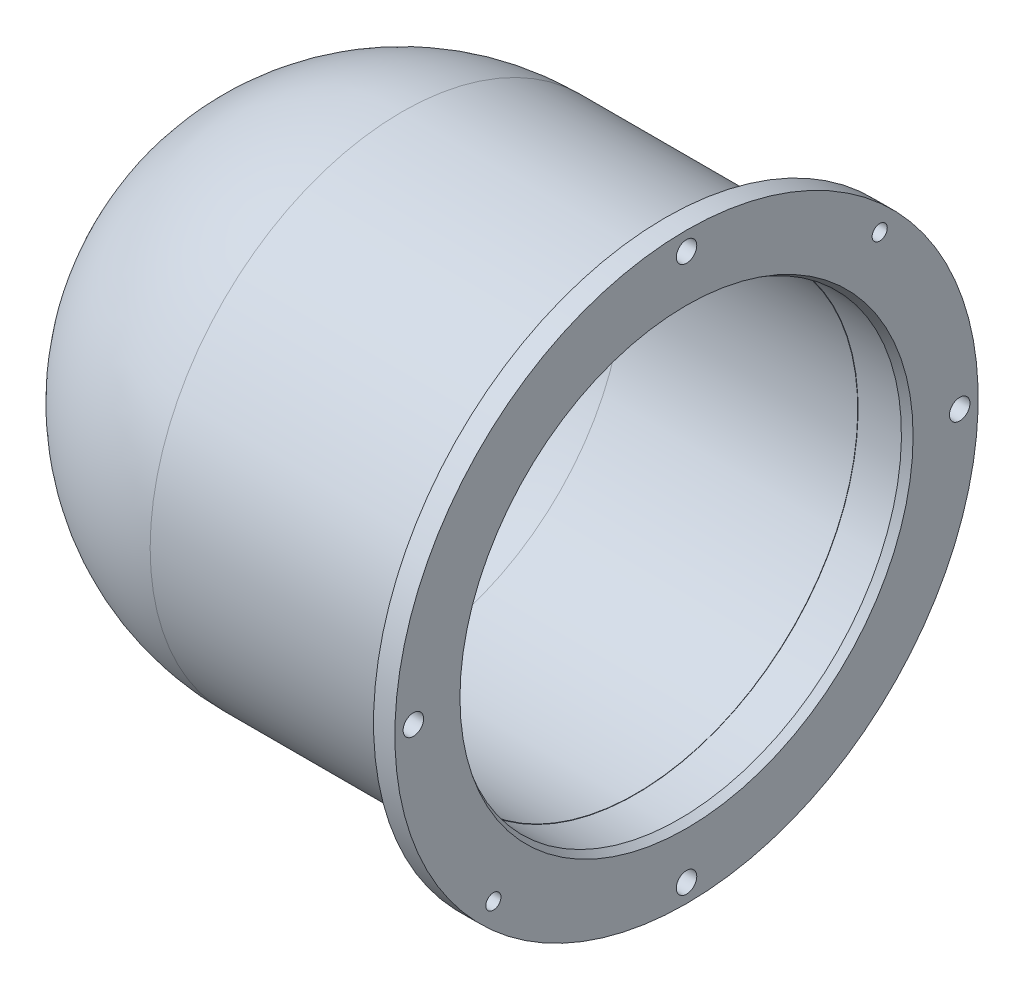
ISO-10303-21;
HEADER;
FILE_DESCRIPTION(('STEP AP214'),'2;1');
FILE_NAME('part.step','',(''),(''),'','','');
FILE_SCHEMA(('AUTOMOTIVE_DESIGN { 1 0 10303 214 1 1 1 1 }'));
ENDSEC;
DATA;
#1=APPLICATION_CONTEXT('core data for automotive mechanical design processes');
#2=APPLICATION_PROTOCOL_DEFINITION('international standard','automotive_design',2000,#1);
#3=PRODUCT_CONTEXT('',#1,'mechanical');
#4=PRODUCT('Part','Part','',(#3));
#5=PRODUCT_RELATED_PRODUCT_CATEGORY('part','',(#4));
#6=PRODUCT_DEFINITION_FORMATION('','',#4);
#7=PRODUCT_DEFINITION_CONTEXT('part definition',#1,'design');
#8=PRODUCT_DEFINITION('design','',#6,#7);
#9=PRODUCT_DEFINITION_SHAPE('','',#8);
#10=(LENGTH_UNIT() NAMED_UNIT(*) SI_UNIT(.MILLI.,.METRE.));
#11=(NAMED_UNIT(*) PLANE_ANGLE_UNIT() SI_UNIT($,.RADIAN.));
#12=(NAMED_UNIT(*) SI_UNIT($,.STERADIAN.) SOLID_ANGLE_UNIT());
#13=UNCERTAINTY_MEASURE_WITH_UNIT(LENGTH_MEASURE(1.E-05),#10,'distance_accuracy_value','');
#14=(GEOMETRIC_REPRESENTATION_CONTEXT(3) GLOBAL_UNCERTAINTY_ASSIGNED_CONTEXT((#13)) GLOBAL_UNIT_ASSIGNED_CONTEXT((#10,
#11,#12)) REPRESENTATION_CONTEXT('',''));
#15=CARTESIAN_POINT('',(0.,0.,0.));
#16=DIRECTION('',(0.,0.,1.));
#17=DIRECTION('',(1.,0.,0.));
#18=AXIS2_PLACEMENT_3D('',#15,#16,#17);
#19=CARTESIAN_POINT('',(-90.8114323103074,0.,0.));
#20=DIRECTION('',(1.,0.,0.));
#21=DIRECTION('',(0.,1.,0.));
#22=AXIS2_PLACEMENT_3D('',#19,#20,#21);
#23=CYLINDRICAL_SURFACE('',#22,44.958);
#24=CARTESIAN_POINT('',(-4.57199999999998,0.,0.));
#25=DIRECTION('',(1.,0.,0.));
#26=DIRECTION('',(0.,1.,0.));
#27=AXIS2_PLACEMENT_3D('',#24,#25,#26);
#28=CIRCLE('',#27,44.958);
#29=CARTESIAN_POINT('',(-4.57199999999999,44.958,0.));
#30=VERTEX_POINT('',#29);
#31=EDGE_CURVE('E10',#30,#30,#28,.F.);
#32=ORIENTED_EDGE('',*,*,#31,.T.);
#33=EDGE_LOOP('',(#32));
#34=FACE_BOUND('',#33,.T.);
#35=CARTESIAN_POINT('',(-50.8,0.,0.));
#36=DIRECTION('',(1.,0.,0.));
#37=DIRECTION('',(0.,1.,0.));
#38=AXIS2_PLACEMENT_3D('',#35,#36,#37);
#39=CIRCLE('',#38,44.958);
#40=CARTESIAN_POINT('',(-50.8,44.958,0.));
#41=VERTEX_POINT('',#40);
#42=EDGE_CURVE('E103',#41,#41,#39,.T.);
#43=ORIENTED_EDGE('',*,*,#42,.T.);
#44=EDGE_LOOP('',(#43));
#45=FACE_BOUND('',#44,.T.);
#46=ADVANCED_FACE('F34',(#34,#45),#23,.T.);
#47=CARTESIAN_POINT('',(-50.8,0.,0.));
#48=DIRECTION('',(1.,0.,0.));
#49=DIRECTION('',(0.,1.,0.));
#50=AXIS2_PLACEMENT_3D('',#47,#48,#49);
#51=SPHERICAL_SURFACE('',#50,44.958);
#52=CARTESIAN_POINT('',(-93.98,0.,0.));
#53=DIRECTION('',(1.,0.,0.));
#54=DIRECTION('',(0.,1.,0.));
#55=AXIS2_PLACEMENT_3D('',#52,#53,#54);
#56=CIRCLE('',#55,12.5183610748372);
#57=CARTESIAN_POINT('',(-93.98,12.5183610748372,0.));
#58=VERTEX_POINT('',#57);
#59=EDGE_CURVE('E84',#58,#58,#56,.F.);
#60=ORIENTED_EDGE('',*,*,#59,.F.);
#61=EDGE_LOOP('',(#60));
#62=FACE_BOUND('',#61,.T.);
#63=ORIENTED_EDGE('',*,*,#42,.F.);
#64=EDGE_LOOP('',(#63));
#65=FACE_BOUND('',#64,.T.);
#66=ADVANCED_FACE('F151',(#62,#65),#51,.T.);
#67=CARTESIAN_POINT('',(-88.3336032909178,-58.888094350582,0.));
#68=DIRECTION('',(1.,0.,0.));
#69=DIRECTION('',(0.,1.,0.));
#70=AXIS2_PLACEMENT_3D('',#67,#68,#69);
#71=PLANE('',#70);
#72=CARTESIAN_POINT('',(-88.3336032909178,0.,0.));
#73=DIRECTION('',(1.,0.,0.));
#74=DIRECTION('',(0.,1.,0.));
#75=AXIS2_PLACEMENT_3D('',#72,#73,#74);
#76=CIRCLE('',#75,5.75436999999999);
#77=CARTESIAN_POINT('',(-88.3336032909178,5.75436999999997,0.));
#78=VERTEX_POINT('',#77);
#79=EDGE_CURVE('E81',#78,#78,#76,.T.);
#80=ORIENTED_EDGE('',*,*,#79,.F.);
#81=EDGE_LOOP('',(#80));
#82=FACE_BOUND('',#81,.T.);
#83=CARTESIAN_POINT('',(-88.3336032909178,0.,0.));
#84=DIRECTION('',(1.,0.,0.));
#85=DIRECTION('',(0.,1.,0.));
#86=AXIS2_PLACEMENT_3D('',#83,#84,#85);
#87=CIRCLE('',#86,12.7);
#88=CARTESIAN_POINT('',(-88.3336032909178,12.7,0.));
#89=VERTEX_POINT('',#88);
#90=EDGE_CURVE('E100',#89,#89,#87,.T.);
#91=ORIENTED_EDGE('',*,*,#90,.T.);
#92=EDGE_LOOP('',(#91));
#93=FACE_BOUND('',#92,.T.);
#94=ADVANCED_FACE('F155',(#82,#93),#71,.T.);
#95=CARTESIAN_POINT('',(-50.8,0.,0.));
#96=DIRECTION('',(1.,0.,0.));
#97=DIRECTION('',(0.,1.,0.));
#98=AXIS2_PLACEMENT_3D('',#95,#96,#97);
#99=SPHERICAL_SURFACE('',#98,39.624);
#100=ORIENTED_EDGE('',*,*,#90,.F.);
#101=EDGE_LOOP('',(#100));
#102=FACE_BOUND('',#101,.T.);
#103=CARTESIAN_POINT('',(-50.8,0.,0.));
#104=DIRECTION('',(1.,0.,0.));
#105=DIRECTION('',(0.,1.,0.));
#106=AXIS2_PLACEMENT_3D('',#103,#104,#105);
#107=CIRCLE('',#106,39.624);
#108=CARTESIAN_POINT('',(-50.8,39.624,0.));
#109=VERTEX_POINT('',#108);
#110=EDGE_CURVE('E97',#109,#109,#107,.T.);
#111=ORIENTED_EDGE('',*,*,#110,.T.);
#112=EDGE_LOOP('',(#111));
#113=FACE_BOUND('',#112,.T.);
#114=ADVANCED_FACE('F146',(#102,#113),#99,.F.);
#115=CARTESIAN_POINT('',(-90.8114323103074,0.,0.));
#116=DIRECTION('',(1.,0.,0.));
#117=DIRECTION('',(0.,1.,0.));
#118=AXIS2_PLACEMENT_3D('',#115,#116,#117);
#119=CYLINDRICAL_SURFACE('',#118,39.624);
#120=ORIENTED_EDGE('',*,*,#110,.F.);
#121=EDGE_LOOP('',(#120));
#122=FACE_BOUND('',#121,.T.);
#123=CARTESIAN_POINT('',(-9.05320611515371,0.,0.));
#124=DIRECTION('',(1.,0.,0.));
#125=DIRECTION('',(0.,1.,0.));
#126=AXIS2_PLACEMENT_3D('',#123,#124,#125);
#127=CIRCLE('',#126,39.624);
#128=CARTESIAN_POINT('',(-9.05320611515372,39.624,0.));
#129=VERTEX_POINT('',#128);
#130=EDGE_CURVE('E94',#129,#129,#127,.T.);
#131=ORIENTED_EDGE('',*,*,#130,.T.);
#132=EDGE_LOOP('',(#131));
#133=FACE_BOUND('',#132,.T.);
#134=ADVANCED_FACE('F140',(#122,#133),#119,.F.);
#135=CARTESIAN_POINT('',(-9.0532061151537,-58.888094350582,0.));
#136=DIRECTION('',(-1.,0.,0.));
#137=DIRECTION('',(0.,-1.,0.));
#138=AXIS2_PLACEMENT_3D('',#135,#136,#137);
#139=PLANE('',#138);
#140=ORIENTED_EDGE('',*,*,#130,.F.);
#141=EDGE_LOOP('',(#140));
#142=FACE_BOUND('',#141,.T.);
#143=CARTESIAN_POINT('',(-9.05320611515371,0.,0.));
#144=DIRECTION('',(1.,0.,0.));
#145=DIRECTION('',(0.,1.,0.));
#146=AXIS2_PLACEMENT_3D('',#143,#144,#145);
#147=CIRCLE('',#146,39.6875);
#148=CARTESIAN_POINT('',(-9.05320611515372,39.6875,0.));
#149=VERTEX_POINT('',#148);
#150=EDGE_CURVE('E91',#149,#149,#147,.T.);
#151=ORIENTED_EDGE('',*,*,#150,.T.);
#152=EDGE_LOOP('',(#151));
#153=FACE_BOUND('',#152,.T.);
#154=ADVANCED_FACE('F135',(#142,#153),#139,.F.);
#155=CARTESIAN_POINT('',(-90.8114323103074,0.,0.));
#156=DIRECTION('',(1.,0.,0.));
#157=DIRECTION('',(0.,1.,0.));
#158=AXIS2_PLACEMENT_3D('',#155,#156,#157);
#159=CYLINDRICAL_SURFACE('',#158,39.6875);
#160=CARTESIAN_POINT('',(-1.31982271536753,0.,0.));
#161=DIRECTION('',(1.,0.,0.));
#162=DIRECTION('',(0.,1.,0.));
#163=AXIS2_PLACEMENT_3D('',#160,#161,#162);
#164=CIRCLE('',#163,39.6875);
#165=CARTESIAN_POINT('',(-1.31982271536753,39.6875,0.));
#166=VERTEX_POINT('',#165);
#167=EDGE_CURVE('E106',#166,#166,#164,.T.);
#168=ORIENTED_EDGE('',*,*,#167,.T.);
#169=EDGE_LOOP('',(#168));
#170=FACE_BOUND('',#169,.T.);
#171=ORIENTED_EDGE('',*,*,#150,.F.);
#172=EDGE_LOOP('',(#171));
#173=FACE_BOUND('',#172,.T.);
#174=ADVANCED_FACE('F132',(#170,#173),#159,.F.);
#175=CARTESIAN_POINT('',(0.,-58.888094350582,0.));
#176=DIRECTION('',(1.,0.,0.));
#177=DIRECTION('',(0.,1.,0.));
#178=AXIS2_PLACEMENT_3D('',#175,#176,#177);
#179=PLANE('',#178);
#180=CARTESIAN_POINT('',(0.,-34.484183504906,34.4841835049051));
#181=DIRECTION('',(1.,0.,0.));
#182=DIRECTION('',(0.,0.,-1.));
#183=AXIS2_PLACEMENT_3D('',#180,#181,#182);
#184=CIRCLE('',#183,1.35254999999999);
#185=CARTESIAN_POINT('',(0.,-34.484183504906,33.1316335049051));
#186=VERTEX_POINT('',#185);
#187=EDGE_CURVE('E63',#186,#186,#184,.T.);
#188=ORIENTED_EDGE('',*,*,#187,.F.);
#189=EDGE_LOOP('',(#188));
#190=FACE_BOUND('',#189,.T.);
#191=CARTESIAN_POINT('',(0.,34.4841835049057,-34.4841835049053));
#192=DIRECTION('',(1.,0.,0.));
#193=DIRECTION('',(0.,0.,-1.));
#194=AXIS2_PLACEMENT_3D('',#191,#192,#193);
#195=CIRCLE('',#194,1.35254999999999);
#196=CARTESIAN_POINT('',(0.,34.4841835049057,-35.8367335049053));
#197=VERTEX_POINT('',#196);
#198=EDGE_CURVE('E52',#197,#197,#195,.T.);
#199=ORIENTED_EDGE('',*,*,#198,.F.);
#200=EDGE_LOOP('',(#199));
#201=FACE_BOUND('',#200,.T.);
#202=CARTESIAN_POINT('',(0.,0.,0.));
#203=DIRECTION('',(1.,0.,0.));
#204=DIRECTION('',(0.,1.,0.));
#205=AXIS2_PLACEMENT_3D('',#202,#203,#204);
#206=CIRCLE('',#205,40.4495);
#207=CARTESIAN_POINT('',(0.,40.4495,0.));
#208=VERTEX_POINT('',#207);
#209=EDGE_CURVE('E46',#208,#208,#206,.F.);
#210=ORIENTED_EDGE('',*,*,#209,.T.);
#211=EDGE_LOOP('',(#210));
#212=FACE_BOUND('',#211,.T.);
#213=CARTESIAN_POINT('',(0.,5.10817981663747E-13,-48.768));
#214=DIRECTION('',(1.,0.,0.));
#215=DIRECTION('',(0.,0.,-1.));
#216=AXIS2_PLACEMENT_3D('',#213,#214,#215);
#217=CIRCLE('',#216,1.8288);
#218=CARTESIAN_POINT('',(0.,5.29973655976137E-13,-50.5968));
#219=VERTEX_POINT('',#218);
#220=EDGE_CURVE('E51',#219,#219,#217,.T.);
#221=ORIENTED_EDGE('',*,*,#220,.F.);
#222=EDGE_LOOP('',(#221));
#223=FACE_BOUND('',#222,.T.);
#224=CARTESIAN_POINT('',(0.,-48.768,-3.40545321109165E-13));
#225=DIRECTION('',(1.,0.,0.));
#226=DIRECTION('',(0.,-1.,0.));
#227=AXIS2_PLACEMENT_3D('',#224,#225,#226);
#228=CIRCLE('',#227,1.8288);
#229=CARTESIAN_POINT('',(0.,-50.5968,-3.53315770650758E-13));
#230=VERTEX_POINT('',#229);
#231=EDGE_CURVE('E66',#230,#230,#228,.T.);
#232=ORIENTED_EDGE('',*,*,#231,.F.);
#233=EDGE_LOOP('',(#232));
#234=FACE_BOUND('',#233,.T.);
#235=CARTESIAN_POINT('',(0.,-1.70272660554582E-13,48.768));
#236=DIRECTION('',(1.,0.,0.));
#237=DIRECTION('',(0.,0.,1.));
#238=AXIS2_PLACEMENT_3D('',#235,#236,#237);
#239=CIRCLE('',#238,1.8288);
#240=CARTESIAN_POINT('',(0.,-1.76657885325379E-13,50.5968));
#241=VERTEX_POINT('',#240);
#242=EDGE_CURVE('E70',#241,#241,#239,.T.);
#243=ORIENTED_EDGE('',*,*,#242,.F.);
#244=EDGE_LOOP('',(#243));
#245=FACE_BOUND('',#244,.T.);
#246=CARTESIAN_POINT('',(0.,48.768,0.));
#247=DIRECTION('',(1.,0.,0.));
#248=DIRECTION('',(0.,1.,0.));
#249=AXIS2_PLACEMENT_3D('',#246,#247,#248);
#250=CIRCLE('',#249,1.8288);
#251=CARTESIAN_POINT('',(0.,50.5968,0.));
#252=VERTEX_POINT('',#251);
#253=EDGE_CURVE('E74',#252,#252,#250,.T.);
#254=ORIENTED_EDGE('',*,*,#253,.F.);
#255=EDGE_LOOP('',(#254));
#256=FACE_BOUND('',#255,.T.);
#257=CARTESIAN_POINT('',(0.,0.,0.));
#258=DIRECTION('',(1.,0.,0.));
#259=DIRECTION('',(0.,1.,0.));
#260=AXIS2_PLACEMENT_3D('',#257,#258,#259);
#261=CIRCLE('',#260,52.07);
#262=CARTESIAN_POINT('',(0.,52.07,0.));
#263=VERTEX_POINT('',#262);
#264=EDGE_CURVE('E88',#263,#263,#261,.T.);
#265=ORIENTED_EDGE('',*,*,#264,.T.);
#266=EDGE_LOOP('',(#265));
#267=FACE_BOUND('',#266,.T.);
#268=ADVANCED_FACE('F121',(#190,#201,#212,#223,#234,#245,#256,#267),#179,.T.);
#269=CARTESIAN_POINT('',(-90.8114323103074,0.,0.));
#270=DIRECTION('',(1.,0.,0.));
#271=DIRECTION('',(0.,1.,0.));
#272=AXIS2_PLACEMENT_3D('',#269,#270,#271);
#273=CYLINDRICAL_SURFACE('',#272,52.07);
#274=ORIENTED_EDGE('',*,*,#264,.F.);
#275=EDGE_LOOP('',(#274));
#276=FACE_BOUND('',#275,.T.);
#277=CARTESIAN_POINT('',(-3.80999999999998,0.,0.));
#278=DIRECTION('',(1.,0.,0.));
#279=DIRECTION('',(0.,1.,0.));
#280=AXIS2_PLACEMENT_3D('',#277,#278,#279);
#281=CIRCLE('',#280,52.07);
#282=CARTESIAN_POINT('',(-3.80999999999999,52.07,0.));
#283=VERTEX_POINT('',#282);
#284=EDGE_CURVE('E85',#283,#283,#281,.T.);
#285=ORIENTED_EDGE('',*,*,#284,.T.);
#286=EDGE_LOOP('',(#285));
#287=FACE_BOUND('',#286,.T.);
#288=ADVANCED_FACE('F192',(#276,#287),#273,.T.);
#289=CARTESIAN_POINT('',(-3.80999999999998,-58.888094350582,0.));
#290=DIRECTION('',(1.,0.,0.));
#291=DIRECTION('',(0.,1.,0.));
#292=AXIS2_PLACEMENT_3D('',#289,#290,#291);
#293=PLANE('',#292);
#294=CARTESIAN_POINT('',(-3.80999999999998,-34.484183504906,34.4841835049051));
#295=DIRECTION('',(1.,0.,0.));
#296=DIRECTION('',(0.,1.,0.));
#297=AXIS2_PLACEMENT_3D('',#294,#295,#296);
#298=CIRCLE('',#297,1.35254999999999);
#299=CARTESIAN_POINT('',(-3.80999999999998,-33.131633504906,34.4841835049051));
#300=VERTEX_POINT('',#299);
#301=EDGE_CURVE('E37',#300,#300,#298,.T.);
#302=ORIENTED_EDGE('',*,*,#301,.T.);
#303=EDGE_LOOP('',(#302));
#304=FACE_BOUND('',#303,.T.);
#305=CARTESIAN_POINT('',(-3.80999999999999,34.4841835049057,-34.4841835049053));
#306=DIRECTION('',(1.,0.,0.));
#307=DIRECTION('',(0.,1.,0.));
#308=AXIS2_PLACEMENT_3D('',#305,#306,#307);
#309=CIRCLE('',#308,1.35254999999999);
#310=CARTESIAN_POINT('',(-3.80999999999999,35.8367335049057,-34.4841835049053));
#311=VERTEX_POINT('',#310);
#312=EDGE_CURVE('E49',#311,#311,#309,.T.);
#313=ORIENTED_EDGE('',*,*,#312,.T.);
#314=EDGE_LOOP('',(#313));
#315=FACE_BOUND('',#314,.T.);
#316=CARTESIAN_POINT('',(-3.80999999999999,0.,0.));
#317=DIRECTION('',(1.,0.,0.));
#318=DIRECTION('',(0.,1.,0.));
#319=AXIS2_PLACEMENT_3D('',#316,#317,#318);
#320=CIRCLE('',#319,45.72);
#321=CARTESIAN_POINT('',(-3.81,45.72,0.));
#322=VERTEX_POINT('',#321);
#323=EDGE_CURVE('E41',#322,#322,#320,.T.);
#324=ORIENTED_EDGE('',*,*,#323,.T.);
#325=EDGE_LOOP('',(#324));
#326=FACE_BOUND('',#325,.T.);
#327=CARTESIAN_POINT('',(-3.80999999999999,5.10030828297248E-13,-48.768));
#328=DIRECTION('',(1.,0.,0.));
#329=DIRECTION('',(0.,1.,0.));
#330=AXIS2_PLACEMENT_3D('',#327,#328,#329);
#331=CIRCLE('',#330,1.8288);
#332=CARTESIAN_POINT('',(-3.80999999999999,1.82880000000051,-48.768));
#333=VERTEX_POINT('',#332);
#334=EDGE_CURVE('E56',#333,#333,#331,.T.);
#335=ORIENTED_EDGE('',*,*,#334,.T.);
#336=EDGE_LOOP('',(#335));
#337=FACE_BOUND('',#336,.T.);
#338=CARTESIAN_POINT('',(-3.80999999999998,-48.768,-3.40545321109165E-13));
#339=DIRECTION('',(1.,0.,0.));
#340=DIRECTION('',(0.,1.,0.));
#341=AXIS2_PLACEMENT_3D('',#338,#339,#340);
#342=CIRCLE('',#341,1.8288);
#343=CARTESIAN_POINT('',(-3.80999999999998,-46.9392,-3.40545321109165E-13));
#344=VERTEX_POINT('',#343);
#345=EDGE_CURVE('E69',#344,#344,#342,.T.);
#346=ORIENTED_EDGE('',*,*,#345,.T.);
#347=EDGE_LOOP('',(#346));
#348=FACE_BOUND('',#347,.T.);
#349=CARTESIAN_POINT('',(-3.80999999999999,-1.71059813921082E-13,48.768));
#350=DIRECTION('',(1.,0.,0.));
#351=DIRECTION('',(0.,1.,0.));
#352=AXIS2_PLACEMENT_3D('',#349,#350,#351);
#353=CIRCLE('',#352,1.8288);
#354=CARTESIAN_POINT('',(-3.80999999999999,1.82879999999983,48.768));
#355=VERTEX_POINT('',#354);
#356=EDGE_CURVE('E73',#355,#355,#353,.T.);
#357=ORIENTED_EDGE('',*,*,#356,.T.);
#358=EDGE_LOOP('',(#357));
#359=FACE_BOUND('',#358,.T.);
#360=CARTESIAN_POINT('',(-3.80999999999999,48.768,0.));
#361=DIRECTION('',(1.,0.,0.));
#362=DIRECTION('',(0.,1.,0.));
#363=AXIS2_PLACEMENT_3D('',#360,#361,#362);
#364=CIRCLE('',#363,1.8288);
#365=CARTESIAN_POINT('',(-3.80999999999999,50.5968,0.));
#366=VERTEX_POINT('',#365);
#367=EDGE_CURVE('E77',#366,#366,#364,.T.);
#368=ORIENTED_EDGE('',*,*,#367,.T.);
#369=EDGE_LOOP('',(#368));
#370=FACE_BOUND('',#369,.T.);
#371=ORIENTED_EDGE('',*,*,#284,.F.);
#372=EDGE_LOOP('',(#371));
#373=FACE_BOUND('',#372,.T.);
#374=ADVANCED_FACE('F196',(#304,#315,#326,#337,#348,#359,#370,#373),#293,.F.);
#375=CARTESIAN_POINT('',(-93.98,0.,0.));
#376=DIRECTION('',(1.,0.,0.));
#377=DIRECTION('',(0.,1.,0.));
#378=AXIS2_PLACEMENT_3D('',#375,#376,#377);
#379=PLANE('',#378);
#380=CARTESIAN_POINT('',(-93.98,0.,0.));
#381=DIRECTION('',(-1.,0.,0.));
#382=DIRECTION('',(0.,0.,1.));
#383=AXIS2_PLACEMENT_3D('',#380,#381,#382);
#384=CIRCLE('',#383,5.75436999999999);
#385=CARTESIAN_POINT('',(-93.98,0.,5.75436999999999));
#386=VERTEX_POINT('',#385);
#387=EDGE_CURVE('E78',#386,#386,#384,.T.);
#388=ORIENTED_EDGE('',*,*,#387,.F.);
#389=EDGE_LOOP('',(#388));
#390=FACE_BOUND('',#389,.T.);
#391=ORIENTED_EDGE('',*,*,#59,.T.);
#392=EDGE_LOOP('',(#391));
#393=FACE_BOUND('',#392,.T.);
#394=ADVANCED_FACE('F216',(#390,#393),#379,.F.);
#395=CARTESIAN_POINT('',(-93.98,0.,0.));
#396=DIRECTION('',(-1.,0.,0.));
#397=DIRECTION('',(0.,0.,1.));
#398=AXIS2_PLACEMENT_3D('',#395,#396,#397);
#399=CYLINDRICAL_SURFACE('',#398,5.75436999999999);
#400=ORIENTED_EDGE('',*,*,#79,.T.);
#401=EDGE_LOOP('',(#400));
#402=FACE_BOUND('',#401,.T.);
#403=ORIENTED_EDGE('',*,*,#387,.T.);
#404=EDGE_LOOP('',(#403));
#405=FACE_BOUND('',#404,.T.);
#406=ADVANCED_FACE('F221',(#402,#405),#399,.F.);
#407=CARTESIAN_POINT('',(-93.98,48.768,0.));
#408=DIRECTION('',(1.,0.,0.));
#409=DIRECTION('',(0.,1.,0.));
#410=AXIS2_PLACEMENT_3D('',#407,#408,#409);
#411=CYLINDRICAL_SURFACE('',#410,1.8288);
#412=ORIENTED_EDGE('',*,*,#253,.T.);
#413=EDGE_LOOP('',(#412));
#414=FACE_BOUND('',#413,.T.);
#415=ORIENTED_EDGE('',*,*,#367,.F.);
#416=EDGE_LOOP('',(#415));
#417=FACE_BOUND('',#416,.T.);
#418=ADVANCED_FACE('F232',(#414,#417),#411,.F.);
#419=CARTESIAN_POINT('',(-93.98,-1.89689110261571E-13,48.768));
#420=DIRECTION('',(1.,0.,0.));
#421=DIRECTION('',(0.,1.,0.));
#422=AXIS2_PLACEMENT_3D('',#419,#420,#421);
#423=CYLINDRICAL_SURFACE('',#422,1.8288);
#424=ORIENTED_EDGE('',*,*,#242,.T.);
#425=EDGE_LOOP('',(#424));
#426=FACE_BOUND('',#425,.T.);
#427=ORIENTED_EDGE('',*,*,#356,.F.);
#428=EDGE_LOOP('',(#427));
#429=FACE_BOUND('',#428,.T.);
#430=ADVANCED_FACE('F244',(#426,#429),#423,.F.);
#431=CARTESIAN_POINT('',(-93.98,-48.768,-3.40545321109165E-13));
#432=DIRECTION('',(1.,0.,0.));
#433=DIRECTION('',(0.,1.,0.));
#434=AXIS2_PLACEMENT_3D('',#431,#432,#433);
#435=CYLINDRICAL_SURFACE('',#434,1.8288);
#436=ORIENTED_EDGE('',*,*,#231,.T.);
#437=EDGE_LOOP('',(#436));
#438=FACE_BOUND('',#437,.T.);
#439=ORIENTED_EDGE('',*,*,#345,.F.);
#440=EDGE_LOOP('',(#439));
#441=FACE_BOUND('',#440,.T.);
#442=ADVANCED_FACE('F254',(#438,#441),#435,.F.);
#443=CARTESIAN_POINT('',(-93.98,4.91401531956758E-13,-48.768));
#444=DIRECTION('',(1.,0.,0.));
#445=DIRECTION('',(0.,1.,0.));
#446=AXIS2_PLACEMENT_3D('',#443,#444,#445);
#447=CYLINDRICAL_SURFACE('',#446,1.8288);
#448=ORIENTED_EDGE('',*,*,#220,.T.);
#449=EDGE_LOOP('',(#448));
#450=FACE_BOUND('',#449,.T.);
#451=ORIENTED_EDGE('',*,*,#334,.F.);
#452=EDGE_LOOP('',(#451));
#453=FACE_BOUND('',#452,.T.);
#454=ADVANCED_FACE('F128',(#450,#453),#447,.F.);
#455=CARTESIAN_POINT('',(-1.31982271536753,0.,0.));
#456=DIRECTION('',(1.,0.,0.));
#457=DIRECTION('',(0.,1.,0.));
#458=AXIS2_PLACEMENT_3D('',#455,#456,#457);
#459=CONICAL_SURFACE('',#458,39.6875,0.5235987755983);
#460=ORIENTED_EDGE('',*,*,#209,.F.);
#461=EDGE_LOOP('',(#460));
#462=FACE_BOUND('',#461,.T.);
#463=ORIENTED_EDGE('',*,*,#167,.F.);
#464=EDGE_LOOP('',(#463));
#465=FACE_BOUND('',#464,.T.);
#466=ADVANCED_FACE('F124',(#462,#465),#459,.F.);
#467=CARTESIAN_POINT('',(-4.57199999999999,0.,0.));
#468=DIRECTION('',(1.,0.,0.));
#469=DIRECTION('',(0.,1.,0.));
#470=AXIS2_PLACEMENT_3D('',#467,#468,#469);
#471=TOROIDAL_SURFACE('',#470,45.72,0.762);
#472=ORIENTED_EDGE('',*,*,#31,.F.);
#473=EDGE_LOOP('',(#472));
#474=FACE_BOUND('',#473,.T.);
#475=ORIENTED_EDGE('',*,*,#323,.F.);
#476=EDGE_LOOP('',(#475));
#477=FACE_BOUND('',#476,.T.);
#478=ADVANCED_FACE('F127',(#474,#477),#471,.F.);
#479=CARTESIAN_POINT('',(0.,34.4841835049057,-34.4841835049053));
#480=DIRECTION('',(1.,0.,0.));
#481=DIRECTION('',(0.,0.,-1.));
#482=AXIS2_PLACEMENT_3D('',#479,#480,#481);
#483=CYLINDRICAL_SURFACE('',#482,1.35254999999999);
#484=ORIENTED_EDGE('',*,*,#198,.T.);
#485=EDGE_LOOP('',(#484));
#486=FACE_BOUND('',#485,.T.);
#487=ORIENTED_EDGE('',*,*,#312,.F.);
#488=EDGE_LOOP('',(#487));
#489=FACE_BOUND('',#488,.T.);
#490=ADVANCED_FACE('F296',(#486,#489),#483,.F.);
#491=CARTESIAN_POINT('',(0.,-34.484183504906,34.4841835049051));
#492=DIRECTION('',(1.,0.,0.));
#493=DIRECTION('',(0.,0.,-1.));
#494=AXIS2_PLACEMENT_3D('',#491,#492,#493);
#495=CYLINDRICAL_SURFACE('',#494,1.35254999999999);
#496=ORIENTED_EDGE('',*,*,#187,.T.);
#497=EDGE_LOOP('',(#496));
#498=FACE_BOUND('',#497,.T.);
#499=ORIENTED_EDGE('',*,*,#301,.F.);
#500=EDGE_LOOP('',(#499));
#501=FACE_BOUND('',#500,.T.);
#502=ADVANCED_FACE('F306',(#498,#501),#495,.F.);
#503=CLOSED_SHELL('',(#46,#66,#94,#114,#134,#154,#174,#268,#288,#374,#394,#406,#418,#430,#442,
#454,#466,#478,#490,#502));
#504=MANIFOLD_SOLID_BREP('B2',#503);
#505=ADVANCED_BREP_SHAPE_REPRESENTATION('',(#18,#504),#14);
#506=SHAPE_DEFINITION_REPRESENTATION(#9,#505);
ENDSEC;
END-ISO-10303-21;
